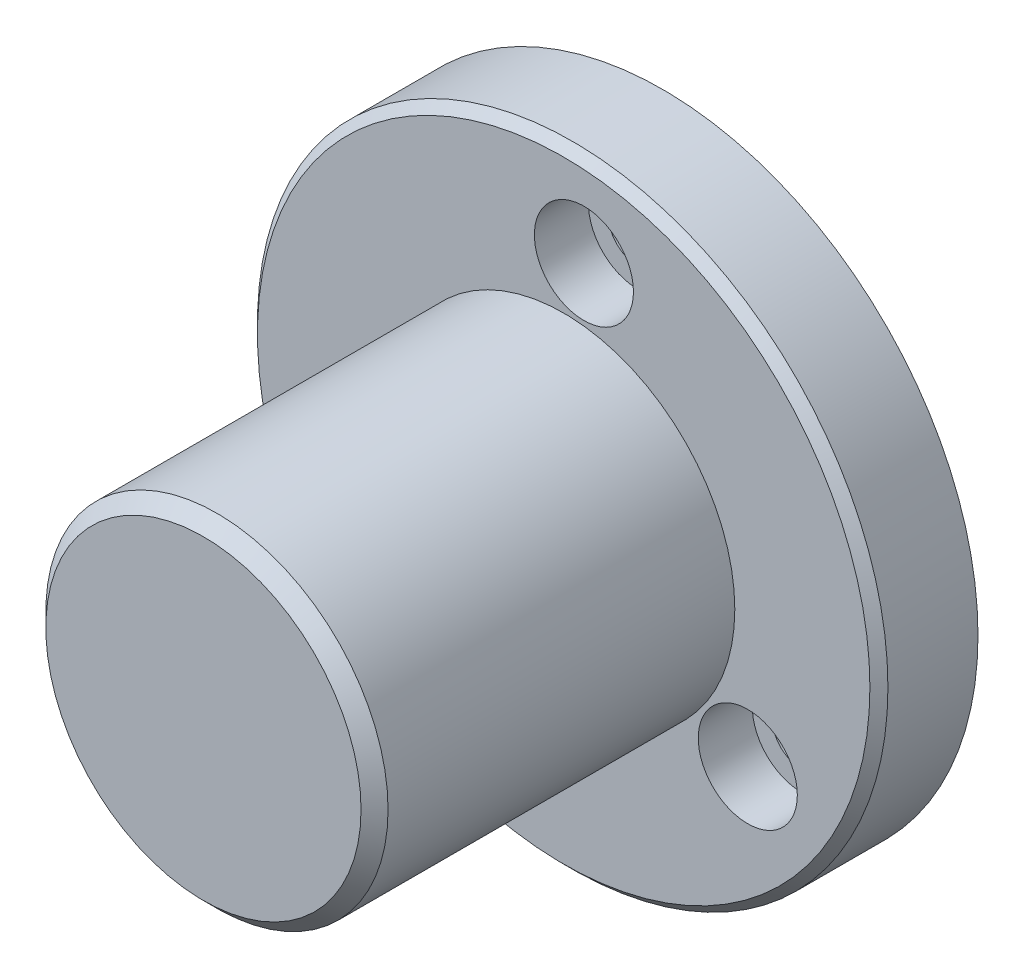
ISO-10303-21;
HEADER;
FILE_DESCRIPTION(('STEP AP214'),'2;1');
FILE_NAME('part.step','',(''),(''),'','','');
FILE_SCHEMA(('AUTOMOTIVE_DESIGN { 1 0 10303 214 1 1 1 1 }'));
ENDSEC;
DATA;
#1=APPLICATION_CONTEXT('core data for automotive mechanical design processes');
#2=APPLICATION_PROTOCOL_DEFINITION('international standard','automotive_design',2000,#1);
#3=PRODUCT_CONTEXT('',#1,'mechanical');
#4=PRODUCT('Part','Part','',(#3));
#5=PRODUCT_RELATED_PRODUCT_CATEGORY('part','',(#4));
#6=PRODUCT_DEFINITION_FORMATION('','',#4);
#7=PRODUCT_DEFINITION_CONTEXT('part definition',#1,'design');
#8=PRODUCT_DEFINITION('design','',#6,#7);
#9=PRODUCT_DEFINITION_SHAPE('','',#8);
#10=(LENGTH_UNIT() NAMED_UNIT(*) SI_UNIT(.MILLI.,.METRE.));
#11=(NAMED_UNIT(*) PLANE_ANGLE_UNIT() SI_UNIT($,.RADIAN.));
#12=(NAMED_UNIT(*) SI_UNIT($,.STERADIAN.) SOLID_ANGLE_UNIT());
#13=UNCERTAINTY_MEASURE_WITH_UNIT(LENGTH_MEASURE(1.E-05),#10,'distance_accuracy_value','');
#14=(GEOMETRIC_REPRESENTATION_CONTEXT(3) GLOBAL_UNCERTAINTY_ASSIGNED_CONTEXT((#13)) GLOBAL_UNIT_ASSIGNED_CONTEXT((#10,
#11,#12)) REPRESENTATION_CONTEXT('',''));
#15=CARTESIAN_POINT('',(0.,0.,0.));
#16=DIRECTION('',(0.,0.,1.));
#17=DIRECTION('',(1.,0.,0.));
#18=AXIS2_PLACEMENT_3D('',#15,#16,#17);
#19=CARTESIAN_POINT('',(-2.1163626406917E-13,-1.17961196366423E-13,11.));
#20=DIRECTION('',(0.,0.,1.));
#21=DIRECTION('',(1.,0.,0.));
#22=AXIS2_PLACEMENT_3D('',#19,#20,#21);
#23=PLANE('',#22);
#24=CARTESIAN_POINT('',(20.4402587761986,-14.394298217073,11.));
#25=DIRECTION('',(0.,0.,1.));
#26=DIRECTION('',(1.,0.,0.));
#27=AXIS2_PLACEMENT_3D('',#24,#25,#26);
#28=CIRCLE('',#27,5.5);
#29=CARTESIAN_POINT('',(25.9402587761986,-14.394298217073,11.));
#30=VERTEX_POINT('',#29);
#31=EDGE_CURVE('E78',#30,#30,#28,.T.);
#32=ORIENTED_EDGE('',*,*,#31,.F.);
#33=EDGE_LOOP('',(#32));
#34=FACE_BOUND('',#33,.T.);
#35=CARTESIAN_POINT('',(-22.6859573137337,-10.5046342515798,11.));
#36=DIRECTION('',(0.,0.,1.));
#37=DIRECTION('',(1.,0.,0.));
#38=AXIS2_PLACEMENT_3D('',#35,#36,#37);
#39=CIRCLE('',#38,5.5);
#40=CARTESIAN_POINT('',(-17.1859573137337,-10.5046342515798,11.));
#41=VERTEX_POINT('',#40);
#42=EDGE_CURVE('E66',#41,#41,#39,.T.);
#43=ORIENTED_EDGE('',*,*,#42,.F.);
#44=EDGE_LOOP('',(#43));
#45=FACE_BOUND('',#44,.T.);
#46=CARTESIAN_POINT('',(2.24569853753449,24.8989324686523,11.));
#47=DIRECTION('',(0.,0.,1.));
#48=DIRECTION('',(1.,0.,0.));
#49=AXIS2_PLACEMENT_3D('',#46,#47,#48);
#50=CIRCLE('',#49,5.5);
#51=CARTESIAN_POINT('',(7.74569853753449,24.8989324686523,11.));
#52=VERTEX_POINT('',#51);
#53=EDGE_CURVE('E54',#52,#52,#50,.T.);
#54=ORIENTED_EDGE('',*,*,#53,.F.);
#55=EDGE_LOOP('',(#54));
#56=FACE_BOUND('',#55,.T.);
#57=CARTESIAN_POINT('',(-2.1163626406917E-13,-1.17961196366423E-13,11.));
#58=DIRECTION('',(0.,0.,1.));
#59=DIRECTION('',(1.,0.,0.));
#60=AXIS2_PLACEMENT_3D('',#57,#58,#59);
#61=CIRCLE('',#60,34.);
#62=CARTESIAN_POINT('',(33.9999999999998,-1.17961196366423E-13,11.));
#63=VERTEX_POINT('',#62);
#64=EDGE_CURVE('E35',#63,#63,#61,.T.);
#65=ORIENTED_EDGE('',*,*,#64,.T.);
#66=EDGE_LOOP('',(#65));
#67=FACE_BOUND('',#66,.T.);
#68=CARTESIAN_POINT('',(-2.1163626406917E-13,-1.17961196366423E-13,11.));
#69=DIRECTION('',(0.,0.,1.));
#70=DIRECTION('',(1.,0.,0.));
#71=AXIS2_PLACEMENT_3D('',#68,#69,#70);
#72=CIRCLE('',#71,19.);
#73=CARTESIAN_POINT('',(18.9999999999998,-1.17961196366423E-13,11.));
#74=VERTEX_POINT('',#73);
#75=EDGE_CURVE('E51',#74,#74,#72,.T.);
#76=ORIENTED_EDGE('',*,*,#75,.F.);
#77=EDGE_LOOP('',(#76));
#78=FACE_BOUND('',#77,.T.);
#79=ADVANCED_FACE('F28',(#34,#45,#56,#67,#78),#23,.T.);
#80=CARTESIAN_POINT('',(-2.1163626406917E-13,-1.17961196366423E-13,11.));
#81=DIRECTION('',(0.,0.,-1.));
#82=DIRECTION('',(-1.,0.,0.));
#83=AXIS2_PLACEMENT_3D('',#80,#81,#82);
#84=CYLINDRICAL_SURFACE('',#83,35.);
#85=CARTESIAN_POINT('',(-2.1163626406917E-13,-1.17961196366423E-13,9.99999999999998));
#86=DIRECTION('',(0.,0.,1.));
#87=DIRECTION('',(1.,0.,0.));
#88=AXIS2_PLACEMENT_3D('',#85,#86,#87);
#89=CIRCLE('',#88,35.);
#90=CARTESIAN_POINT('',(34.9999999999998,-1.17961196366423E-13,9.99999999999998));
#91=VERTEX_POINT('',#90);
#92=EDGE_CURVE('E10',#91,#91,#89,.F.);
#93=ORIENTED_EDGE('',*,*,#92,.T.);
#94=EDGE_LOOP('',(#93));
#95=FACE_BOUND('',#94,.T.);
#96=CARTESIAN_POINT('',(-2.1163626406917E-13,-1.17961196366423E-13,0.));
#97=DIRECTION('',(0.,0.,1.));
#98=DIRECTION('',(1.,0.,0.));
#99=AXIS2_PLACEMENT_3D('',#96,#97,#98);
#100=CIRCLE('',#99,35.);
#101=CARTESIAN_POINT('',(34.9999999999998,-1.17961196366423E-13,0.));
#102=VERTEX_POINT('',#101);
#103=EDGE_CURVE('E48',#102,#102,#100,.T.);
#104=ORIENTED_EDGE('',*,*,#103,.T.);
#105=EDGE_LOOP('',(#104));
#106=FACE_BOUND('',#105,.T.);
#107=ADVANCED_FACE('F30',(#95,#106),#84,.T.);
#108=CARTESIAN_POINT('',(-2.1163626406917E-13,-1.17961196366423E-13,0.));
#109=DIRECTION('',(0.,0.,1.));
#110=DIRECTION('',(1.,0.,0.));
#111=AXIS2_PLACEMENT_3D('',#108,#109,#110);
#112=PLANE('',#111);
#113=CARTESIAN_POINT('',(20.4402587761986,-14.394298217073,0.));
#114=DIRECTION('',(0.,0.,1.));
#115=DIRECTION('',(1.,0.,0.));
#116=AXIS2_PLACEMENT_3D('',#113,#114,#115);
#117=CIRCLE('',#116,3.3);
#118=CARTESIAN_POINT('',(23.7402587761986,-14.394298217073,0.));
#119=VERTEX_POINT('',#118);
#120=EDGE_CURVE('E87',#119,#119,#117,.T.);
#121=ORIENTED_EDGE('',*,*,#120,.T.);
#122=EDGE_LOOP('',(#121));
#123=FACE_BOUND('',#122,.T.);
#124=CARTESIAN_POINT('',(-22.6859573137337,-10.5046342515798,0.));
#125=DIRECTION('',(0.,0.,1.));
#126=DIRECTION('',(1.,0.,0.));
#127=AXIS2_PLACEMENT_3D('',#124,#125,#126);
#128=CIRCLE('',#127,3.3);
#129=CARTESIAN_POINT('',(-19.3859573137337,-10.5046342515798,0.));
#130=VERTEX_POINT('',#129);
#131=EDGE_CURVE('E75',#130,#130,#128,.T.);
#132=ORIENTED_EDGE('',*,*,#131,.T.);
#133=EDGE_LOOP('',(#132));
#134=FACE_BOUND('',#133,.T.);
#135=CARTESIAN_POINT('',(2.24569853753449,24.8989324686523,0.));
#136=DIRECTION('',(0.,0.,1.));
#137=DIRECTION('',(1.,0.,0.));
#138=AXIS2_PLACEMENT_3D('',#135,#136,#137);
#139=CIRCLE('',#138,3.3);
#140=CARTESIAN_POINT('',(5.54569853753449,24.8989324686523,0.));
#141=VERTEX_POINT('',#140);
#142=EDGE_CURVE('E63',#141,#141,#139,.T.);
#143=ORIENTED_EDGE('',*,*,#142,.T.);
#144=EDGE_LOOP('',(#143));
#145=FACE_BOUND('',#144,.T.);
#146=ORIENTED_EDGE('',*,*,#103,.F.);
#147=EDGE_LOOP('',(#146));
#148=FACE_BOUND('',#147,.T.);
#149=ADVANCED_FACE('F91',(#123,#134,#145,#148),#112,.F.);
#150=CARTESIAN_POINT('',(-2.1163626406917E-13,-1.17961196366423E-13,51.));
#151=DIRECTION('',(0.,0.,-1.));
#152=DIRECTION('',(-1.,0.,0.));
#153=AXIS2_PLACEMENT_3D('',#150,#151,#152);
#154=CYLINDRICAL_SURFACE('',#153,19.);
#155=CARTESIAN_POINT('',(-2.1163626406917E-13,-1.17961196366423E-13,49.5));
#156=DIRECTION('',(0.,0.,1.));
#157=DIRECTION('',(1.,0.,0.));
#158=AXIS2_PLACEMENT_3D('',#155,#156,#157);
#159=CIRCLE('',#158,19.);
#160=CARTESIAN_POINT('',(18.9999999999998,-1.17961196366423E-13,49.5));
#161=VERTEX_POINT('',#160);
#162=EDGE_CURVE('E39',#161,#161,#159,.F.);
#163=ORIENTED_EDGE('',*,*,#162,.T.);
#164=EDGE_LOOP('',(#163));
#165=FACE_BOUND('',#164,.T.);
#166=ORIENTED_EDGE('',*,*,#75,.T.);
#167=EDGE_LOOP('',(#166));
#168=FACE_BOUND('',#167,.T.);
#169=ADVANCED_FACE('F121',(#165,#168),#154,.T.);
#170=CARTESIAN_POINT('',(-2.1163626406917E-13,-1.17961196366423E-13,51.));
#171=DIRECTION('',(0.,0.,1.));
#172=DIRECTION('',(1.,0.,0.));
#173=AXIS2_PLACEMENT_3D('',#170,#171,#172);
#174=PLANE('',#173);
#175=CARTESIAN_POINT('',(-2.1163626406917E-13,-1.17961196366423E-13,51.));
#176=DIRECTION('',(0.,0.,1.));
#177=DIRECTION('',(1.,0.,0.));
#178=AXIS2_PLACEMENT_3D('',#175,#176,#177);
#179=CIRCLE('',#178,17.5);
#180=CARTESIAN_POINT('',(17.4999999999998,-1.17961196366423E-13,51.));
#181=VERTEX_POINT('',#180);
#182=EDGE_CURVE('E43',#181,#181,#179,.T.);
#183=ORIENTED_EDGE('',*,*,#182,.T.);
#184=EDGE_LOOP('',(#183));
#185=FACE_BOUND('',#184,.T.);
#186=ADVANCED_FACE('F123',(#185),#174,.T.);
#187=CARTESIAN_POINT('',(-2.1163626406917E-13,-1.17961196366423E-13,51.));
#188=DIRECTION('',(0.,0.,-1.));
#189=DIRECTION('',(-1.,0.,0.));
#190=AXIS2_PLACEMENT_3D('',#187,#188,#189);
#191=CONICAL_SURFACE('',#190,17.5,0.785398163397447);
#192=ORIENTED_EDGE('',*,*,#162,.F.);
#193=EDGE_LOOP('',(#192));
#194=FACE_BOUND('',#193,.T.);
#195=ORIENTED_EDGE('',*,*,#182,.F.);
#196=EDGE_LOOP('',(#195));
#197=FACE_BOUND('',#196,.T.);
#198=ADVANCED_FACE('F130',(#194,#197),#191,.T.);
#199=CARTESIAN_POINT('',(-2.1163626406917E-13,-1.17961196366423E-13,11.));
#200=DIRECTION('',(0.,0.,-1.));
#201=DIRECTION('',(-1.,0.,0.));
#202=AXIS2_PLACEMENT_3D('',#199,#200,#201);
#203=CONICAL_SURFACE('',#202,34.,0.785398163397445);
#204=ORIENTED_EDGE('',*,*,#92,.F.);
#205=EDGE_LOOP('',(#204));
#206=FACE_BOUND('',#205,.T.);
#207=ORIENTED_EDGE('',*,*,#64,.F.);
#208=EDGE_LOOP('',(#207));
#209=FACE_BOUND('',#208,.T.);
#210=ADVANCED_FACE('F137',(#206,#209),#203,.T.);
#211=CARTESIAN_POINT('',(2.24569853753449,24.8989324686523,11.));
#212=DIRECTION('',(0.,0.,1.));
#213=DIRECTION('',(1.,0.,0.));
#214=AXIS2_PLACEMENT_3D('',#211,#212,#213);
#215=CYLINDRICAL_SURFACE('',#214,5.5);
#216=CARTESIAN_POINT('',(2.24569853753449,24.8989324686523,5.));
#217=DIRECTION('',(0.,0.,1.));
#218=DIRECTION('',(1.,0.,0.));
#219=AXIS2_PLACEMENT_3D('',#216,#217,#218);
#220=CIRCLE('',#219,5.5);
#221=CARTESIAN_POINT('',(7.74569853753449,24.8989324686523,5.));
#222=VERTEX_POINT('',#221);
#223=EDGE_CURVE('E57',#222,#222,#220,.T.);
#224=ORIENTED_EDGE('',*,*,#223,.F.);
#225=EDGE_LOOP('',(#224));
#226=FACE_BOUND('',#225,.T.);
#227=ORIENTED_EDGE('',*,*,#53,.T.);
#228=EDGE_LOOP('',(#227));
#229=FACE_BOUND('',#228,.T.);
#230=ADVANCED_FACE('F141',(#226,#229),#215,.F.);
#231=CARTESIAN_POINT('',(5.54569853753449,24.8989324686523,5.));
#232=DIRECTION('',(0.,0.,-1.));
#233=DIRECTION('',(-1.,0.,0.));
#234=AXIS2_PLACEMENT_3D('',#231,#232,#233);
#235=PLANE('',#234);
#236=CARTESIAN_POINT('',(2.24569853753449,24.8989324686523,5.));
#237=DIRECTION('',(0.,0.,1.));
#238=DIRECTION('',(1.,0.,0.));
#239=AXIS2_PLACEMENT_3D('',#236,#237,#238);
#240=CIRCLE('',#239,3.3);
#241=CARTESIAN_POINT('',(5.54569853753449,24.8989324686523,5.));
#242=VERTEX_POINT('',#241);
#243=EDGE_CURVE('E60',#242,#242,#240,.T.);
#244=ORIENTED_EDGE('',*,*,#243,.F.);
#245=EDGE_LOOP('',(#244));
#246=FACE_BOUND('',#245,.T.);
#247=ORIENTED_EDGE('',*,*,#223,.T.);
#248=EDGE_LOOP('',(#247));
#249=FACE_BOUND('',#248,.T.);
#250=ADVANCED_FACE('F145',(#246,#249),#235,.F.);
#251=CARTESIAN_POINT('',(2.24569853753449,24.8989324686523,11.));
#252=DIRECTION('',(0.,0.,1.));
#253=DIRECTION('',(1.,0.,0.));
#254=AXIS2_PLACEMENT_3D('',#251,#252,#253);
#255=CYLINDRICAL_SURFACE('',#254,3.3);
#256=ORIENTED_EDGE('',*,*,#142,.F.);
#257=EDGE_LOOP('',(#256));
#258=FACE_BOUND('',#257,.T.);
#259=ORIENTED_EDGE('',*,*,#243,.T.);
#260=EDGE_LOOP('',(#259));
#261=FACE_BOUND('',#260,.T.);
#262=ADVANCED_FACE('F149',(#258,#261),#255,.F.);
#263=CARTESIAN_POINT('',(-22.6859573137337,-10.5046342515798,11.));
#264=DIRECTION('',(0.,0.,1.));
#265=DIRECTION('',(1.,0.,0.));
#266=AXIS2_PLACEMENT_3D('',#263,#264,#265);
#267=CYLINDRICAL_SURFACE('',#266,5.5);
#268=CARTESIAN_POINT('',(-22.6859573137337,-10.5046342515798,5.));
#269=DIRECTION('',(0.,0.,1.));
#270=DIRECTION('',(1.,0.,0.));
#271=AXIS2_PLACEMENT_3D('',#268,#269,#270);
#272=CIRCLE('',#271,5.5);
#273=CARTESIAN_POINT('',(-17.1859573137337,-10.5046342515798,5.));
#274=VERTEX_POINT('',#273);
#275=EDGE_CURVE('E69',#274,#274,#272,.T.);
#276=ORIENTED_EDGE('',*,*,#275,.F.);
#277=EDGE_LOOP('',(#276));
#278=FACE_BOUND('',#277,.T.);
#279=ORIENTED_EDGE('',*,*,#42,.T.);
#280=EDGE_LOOP('',(#279));
#281=FACE_BOUND('',#280,.T.);
#282=ADVANCED_FACE('F153',(#278,#281),#267,.F.);
#283=CARTESIAN_POINT('',(-19.3859573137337,-10.5046342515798,5.));
#284=DIRECTION('',(0.,0.,-1.));
#285=DIRECTION('',(-1.,0.,0.));
#286=AXIS2_PLACEMENT_3D('',#283,#284,#285);
#287=PLANE('',#286);
#288=CARTESIAN_POINT('',(-22.6859573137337,-10.5046342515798,5.));
#289=DIRECTION('',(0.,0.,1.));
#290=DIRECTION('',(1.,0.,0.));
#291=AXIS2_PLACEMENT_3D('',#288,#289,#290);
#292=CIRCLE('',#291,3.3);
#293=CARTESIAN_POINT('',(-19.3859573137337,-10.5046342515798,5.));
#294=VERTEX_POINT('',#293);
#295=EDGE_CURVE('E72',#294,#294,#292,.T.);
#296=ORIENTED_EDGE('',*,*,#295,.F.);
#297=EDGE_LOOP('',(#296));
#298=FACE_BOUND('',#297,.T.);
#299=ORIENTED_EDGE('',*,*,#275,.T.);
#300=EDGE_LOOP('',(#299));
#301=FACE_BOUND('',#300,.T.);
#302=ADVANCED_FACE('F157',(#298,#301),#287,.F.);
#303=CARTESIAN_POINT('',(-22.6859573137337,-10.5046342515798,11.));
#304=DIRECTION('',(0.,0.,1.));
#305=DIRECTION('',(1.,0.,0.));
#306=AXIS2_PLACEMENT_3D('',#303,#304,#305);
#307=CYLINDRICAL_SURFACE('',#306,3.3);
#308=ORIENTED_EDGE('',*,*,#131,.F.);
#309=EDGE_LOOP('',(#308));
#310=FACE_BOUND('',#309,.T.);
#311=ORIENTED_EDGE('',*,*,#295,.T.);
#312=EDGE_LOOP('',(#311));
#313=FACE_BOUND('',#312,.T.);
#314=ADVANCED_FACE('F109',(#310,#313),#307,.F.);
#315=CARTESIAN_POINT('',(20.4402587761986,-14.394298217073,11.));
#316=DIRECTION('',(0.,0.,1.));
#317=DIRECTION('',(1.,0.,0.));
#318=AXIS2_PLACEMENT_3D('',#315,#316,#317);
#319=CYLINDRICAL_SURFACE('',#318,5.5);
#320=CARTESIAN_POINT('',(20.4402587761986,-14.394298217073,5.));
#321=DIRECTION('',(0.,0.,1.));
#322=DIRECTION('',(1.,0.,0.));
#323=AXIS2_PLACEMENT_3D('',#320,#321,#322);
#324=CIRCLE('',#323,5.5);
#325=CARTESIAN_POINT('',(25.9402587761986,-14.394298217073,5.));
#326=VERTEX_POINT('',#325);
#327=EDGE_CURVE('E81',#326,#326,#324,.T.);
#328=ORIENTED_EDGE('',*,*,#327,.F.);
#329=EDGE_LOOP('',(#328));
#330=FACE_BOUND('',#329,.T.);
#331=ORIENTED_EDGE('',*,*,#31,.T.);
#332=EDGE_LOOP('',(#331));
#333=FACE_BOUND('',#332,.T.);
#334=ADVANCED_FACE('F103',(#330,#333),#319,.F.);
#335=CARTESIAN_POINT('',(23.7402587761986,-14.394298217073,5.));
#336=DIRECTION('',(0.,0.,-1.));
#337=DIRECTION('',(-1.,0.,0.));
#338=AXIS2_PLACEMENT_3D('',#335,#336,#337);
#339=PLANE('',#338);
#340=CARTESIAN_POINT('',(20.4402587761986,-14.394298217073,5.));
#341=DIRECTION('',(0.,0.,1.));
#342=DIRECTION('',(1.,0.,0.));
#343=AXIS2_PLACEMENT_3D('',#340,#341,#342);
#344=CIRCLE('',#343,3.3);
#345=CARTESIAN_POINT('',(23.7402587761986,-14.394298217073,5.));
#346=VERTEX_POINT('',#345);
#347=EDGE_CURVE('E84',#346,#346,#344,.T.);
#348=ORIENTED_EDGE('',*,*,#347,.F.);
#349=EDGE_LOOP('',(#348));
#350=FACE_BOUND('',#349,.T.);
#351=ORIENTED_EDGE('',*,*,#327,.T.);
#352=EDGE_LOOP('',(#351));
#353=FACE_BOUND('',#352,.T.);
#354=ADVANCED_FACE('F97',(#350,#353),#339,.F.);
#355=CARTESIAN_POINT('',(20.4402587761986,-14.394298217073,11.));
#356=DIRECTION('',(0.,0.,1.));
#357=DIRECTION('',(1.,0.,0.));
#358=AXIS2_PLACEMENT_3D('',#355,#356,#357);
#359=CYLINDRICAL_SURFACE('',#358,3.3);
#360=ORIENTED_EDGE('',*,*,#120,.F.);
#361=EDGE_LOOP('',(#360));
#362=FACE_BOUND('',#361,.T.);
#363=ORIENTED_EDGE('',*,*,#347,.T.);
#364=EDGE_LOOP('',(#363));
#365=FACE_BOUND('',#364,.T.);
#366=ADVANCED_FACE('F94',(#362,#365),#359,.F.);
#367=CLOSED_SHELL('',(#79,#107,#149,#169,#186,#198,#210,#230,#250,#262,#282,#302,#314,#334,#354,#366));
#368=MANIFOLD_SOLID_BREP('B2',#367);
#369=ADVANCED_BREP_SHAPE_REPRESENTATION('',(#18,#368),#14);
#370=SHAPE_DEFINITION_REPRESENTATION(#9,#369);
ENDSEC;
END-ISO-10303-21;
